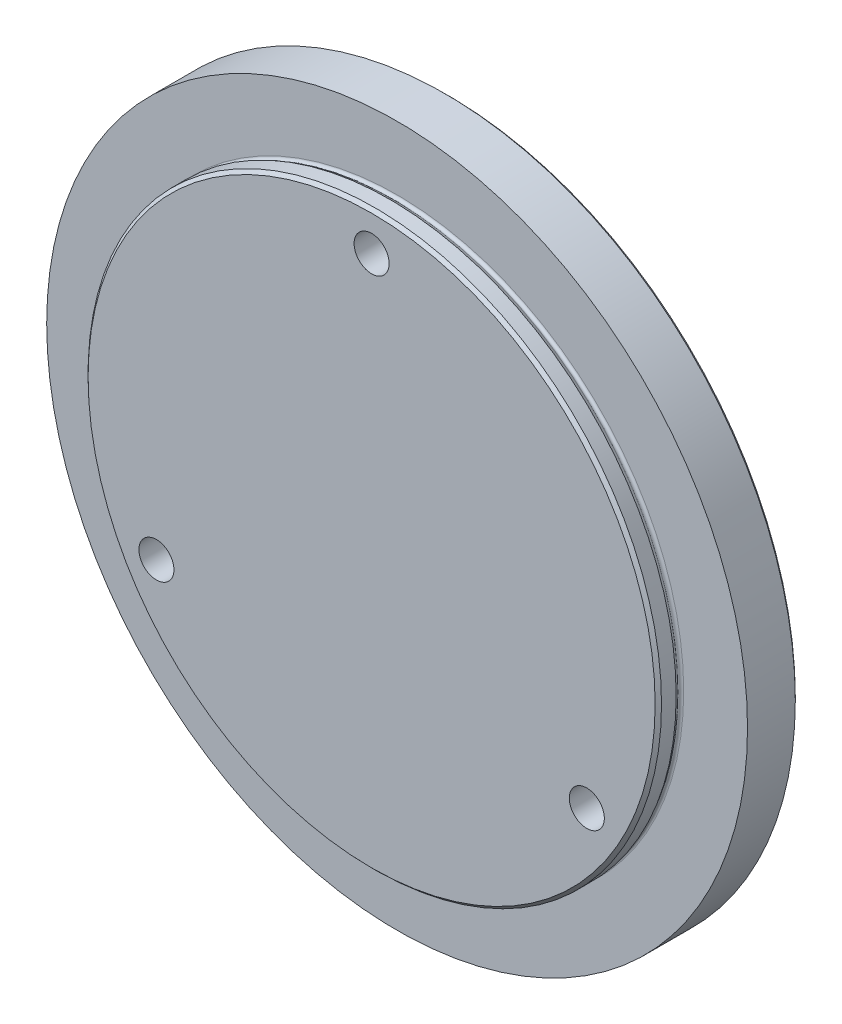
from build123d import *

# Parameters (mm, degrees)
CBORE_FOR_M5_HEX_SOCKET_HEAD_CAP_SCREW1_D           = 5.5
CBORE_FOR_M5_HEX_SOCKET_HEAD_CAP_SCREW1_CBORE_D     = 10
CBORE_FOR_M5_HEX_SOCKET_HEAD_CAP_SCREW1_CBORE_DEPTH = 5.7


with BuildPart() as part:
    # Sketch1 → Revolve1 (revolve)
    with BuildSketch(Plane(origin=(0, -18, -1.35), x_dir=(0, 0, -1), z_dir=(1, 0, 0)), mode=Mode.PRIVATE) as revolve1_sk:
        Polygon((-5.35, 18), (6.65, 18), (6.65, 63), (-4.85, 63), (-5.35, 62.5), align=None)
    revolve(revolve1_sk.sketch.rotate(Axis((0, 0, -8), (0, 0, -1)), 90), axis=Axis((0, 0, -8), (0, 0, -1)))

    # Sketch2 → Revolve2 (revolve)
    with BuildSketch(Plane(origin=(0, 0, 0), x_dir=(0, 0, -1), z_dir=(1, 0, 0)), mode=Mode.PRIVATE) as revolve2_sk:
        Polygon((7.5, 55), (8, 54.5), (8, 45), (0, 45), (0, 55), align=None)
    revolve(revolve2_sk.sketch.rotate(Axis((0, 0, -8), (0, 0, -1)), 90), axis=Axis((0, 0, -8), (0, 0, -1)))

    # Sketch3 → Cut-Revolve1 (revolve, cut)
    with BuildSketch(Plane(origin=(0, 0, 0), x_dir=(0, 0, -1), z_dir=(1, 0, 0)), mode=Mode.PRIVATE) as cut_revolve1_sk:
        with BuildLine():
            Line((-1.2, 45), (0, 45))
            Line((0, 45), (0, 44.985964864))
            ThreePointArc((0, 44.985964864), (-0.203030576, 44.637822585), (-0.60601523, 44.643097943))
            Line((-0.60601523, 44.643097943), (-1.2, 45))
        make_face()
    revolve(cut_revolve1_sk.sketch.rotate(Axis((0, 0, -8), (0, 0, -1)), 90), axis=Axis((0, 0, -8), (0, 0, -1)), mode=Mode.SUBTRACT)

    # CBORE for M5 Hex Socket Head Cap Screw1 (through all)
    with Locations(Plane(origin=(0, 0, -8), x_dir=(-1, 0, 0), z_dir=(0, 0, -1))):
        with Locations((0, 39), (33.774990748, -19.5), (-33.774990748, -19.5)):
            CounterBoreHole(CBORE_FOR_M5_HEX_SOCKET_HEAD_CAP_SCREW1_D / 2, CBORE_FOR_M5_HEX_SOCKET_HEAD_CAP_SCREW1_CBORE_D / 2, CBORE_FOR_M5_HEX_SOCKET_HEAD_CAP_SCREW1_CBORE_DEPTH)


solid = part.part
